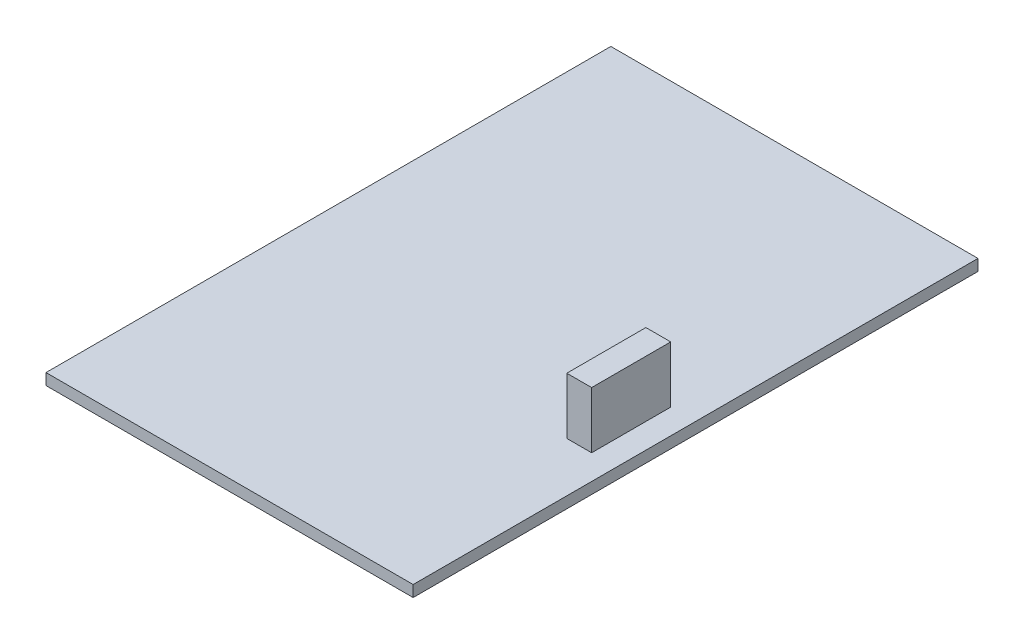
from build123d import *

# Parameters (mm, degrees)
SCHIZZO1_W                   = 325
SCHIZZO1_H                   = 500
ESTRUSIONE_ESTRUSIONE1_DEPTH = 10
SCHIZZO2_W                   = 22
SCHIZZO2_H                   = 70
ESTRUSIONE_ESTRUSIONE2_DEPTH = 50


with BuildPart() as part:
    # Schizzo1 → Estrusione-Estrusione1 (new body)
    with BuildSketch(Plane(origin=(0, 0, 0), x_dir=(1, 0, 0), z_dir=(0, 1, 0))):
        with Locations((162.5, 250)):
            Rectangle(SCHIZZO1_W, SCHIZZO1_H)
    extrude(amount=ESTRUSIONE_ESTRUSIONE1_DEPTH)

    # Schizzo2 → Estrusione-Estrusione2 (add)
    with BuildSketch(Plane(origin=(0, 10, 0), x_dir=(1, 0, 0), z_dir=(0, 1, 0))):
        with Locations((292, 215)):
            Rectangle(SCHIZZO2_W, SCHIZZO2_H)
    extrude(amount=ESTRUSIONE_ESTRUSIONE2_DEPTH)


solid = part.part
